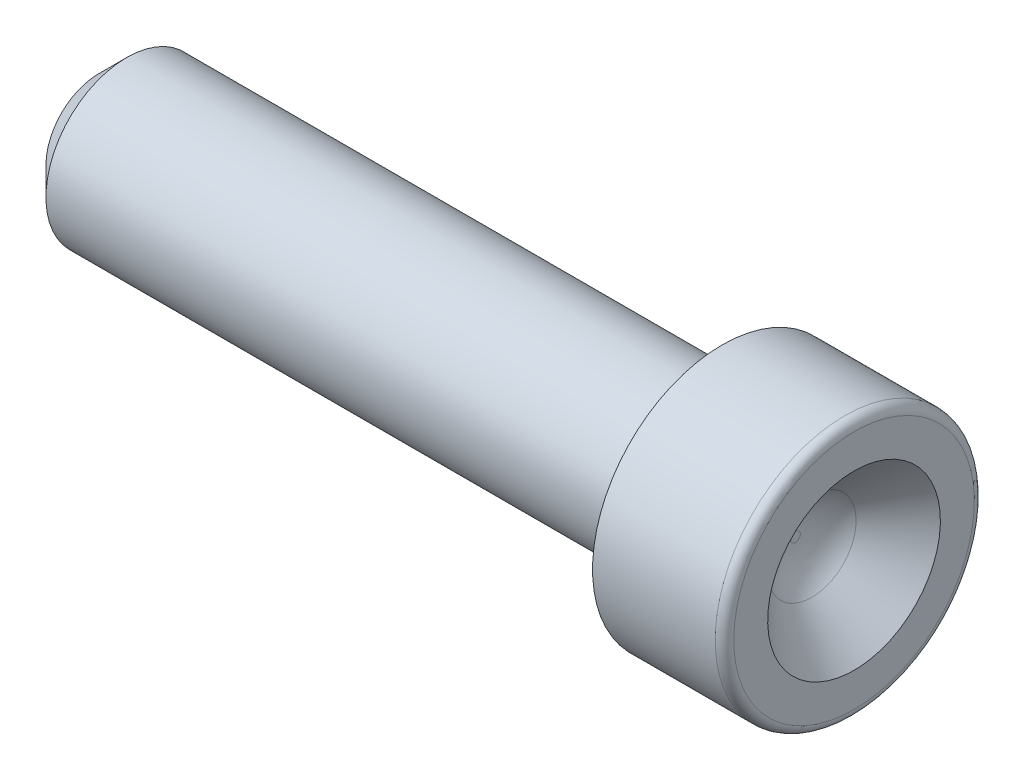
ISO-10303-21;
HEADER;
FILE_DESCRIPTION(('STEP AP214'),'2;1');
FILE_NAME('part.step','',(''),(''),'','','');
FILE_SCHEMA(('AUTOMOTIVE_DESIGN { 1 0 10303 214 1 1 1 1 }'));
ENDSEC;
DATA;
#1=APPLICATION_CONTEXT('core data for automotive mechanical design processes');
#2=APPLICATION_PROTOCOL_DEFINITION('international standard','automotive_design',2000,#1);
#3=PRODUCT_CONTEXT('',#1,'mechanical');
#4=PRODUCT('Part','Part','',(#3));
#5=PRODUCT_RELATED_PRODUCT_CATEGORY('part','',(#4));
#6=PRODUCT_DEFINITION_FORMATION('','',#4);
#7=PRODUCT_DEFINITION_CONTEXT('part definition',#1,'design');
#8=PRODUCT_DEFINITION('design','',#6,#7);
#9=PRODUCT_DEFINITION_SHAPE('','',#8);
#10=(LENGTH_UNIT() NAMED_UNIT(*) SI_UNIT(.MILLI.,.METRE.));
#11=(NAMED_UNIT(*) PLANE_ANGLE_UNIT() SI_UNIT($,.RADIAN.));
#12=(NAMED_UNIT(*) SI_UNIT($,.STERADIAN.) SOLID_ANGLE_UNIT());
#13=UNCERTAINTY_MEASURE_WITH_UNIT(LENGTH_MEASURE(1.E-05),#10,'distance_accuracy_value','');
#14=(GEOMETRIC_REPRESENTATION_CONTEXT(3) GLOBAL_UNCERTAINTY_ASSIGNED_CONTEXT((#13)) GLOBAL_UNIT_ASSIGNED_CONTEXT((#10,
#11,#12)) REPRESENTATION_CONTEXT('',''));
#15=CARTESIAN_POINT('',(0.,0.,0.));
#16=DIRECTION('',(0.,0.,1.));
#17=DIRECTION('',(1.,0.,0.));
#18=AXIS2_PLACEMENT_3D('',#15,#16,#17);
#19=CARTESIAN_POINT('',(0.,2.21,0.));
#20=DIRECTION('',(1.,0.,0.));
#21=DIRECTION('',(0.,1.,0.));
#22=AXIS2_PLACEMENT_3D('',#19,#20,#21);
#23=PLANE('',#22);
#24=CARTESIAN_POINT('',(0.,2.21,0.));
#25=DIRECTION('',(1.,0.,0.));
#26=DIRECTION('',(0.,1.,0.));
#27=AXIS2_PLACEMENT_3D('',#24,#25,#26);
#28=CIRCLE('',#27,1.44799999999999);
#29=CARTESIAN_POINT('',(0.,2.21,-1.44799999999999));
#30=VERTEX_POINT('',#29);
#31=EDGE_CURVE('E48',#30,#30,#28,.F.);
#32=ORIENTED_EDGE('',*,*,#31,.T.);
#33=EDGE_LOOP('',(#32));
#34=FACE_BOUND('',#33,.T.);
#35=ADVANCED_FACE('F28',(#34),#23,.F.);
#36=CARTESIAN_POINT('',(19.05,2.21,0.));
#37=DIRECTION('',(1.,0.,0.));
#38=DIRECTION('',(0.,1.,0.));
#39=AXIS2_PLACEMENT_3D('',#36,#37,#38);
#40=CYLINDRICAL_SURFACE('',#39,2.21);
#41=CARTESIAN_POINT('',(0.762000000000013,2.21,0.));
#42=DIRECTION('',(1.,0.,0.));
#43=DIRECTION('',(0.,0.,-1.));
#44=AXIS2_PLACEMENT_3D('',#41,#42,#43);
#45=CIRCLE('',#44,2.21);
#46=CARTESIAN_POINT('',(0.762000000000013,2.21,-2.21));
#47=VERTEX_POINT('',#46);
#48=EDGE_CURVE('E51',#47,#47,#45,.T.);
#49=ORIENTED_EDGE('',*,*,#48,.T.);
#50=EDGE_LOOP('',(#49));
#51=FACE_BOUND('',#50,.T.);
#52=CARTESIAN_POINT('',(16.535,2.21,0.));
#53=DIRECTION('',(1.,0.,0.));
#54=DIRECTION('',(0.,1.,0.));
#55=AXIS2_PLACEMENT_3D('',#52,#53,#54);
#56=CIRCLE('',#55,2.21);
#57=CARTESIAN_POINT('',(16.535,4.42,0.));
#58=VERTEX_POINT('',#57);
#59=EDGE_CURVE('E54',#58,#58,#56,.F.);
#60=ORIENTED_EDGE('',*,*,#59,.T.);
#61=EDGE_LOOP('',(#60));
#62=FACE_BOUND('',#61,.T.);
#63=ADVANCED_FACE('F83',(#51,#62),#40,.T.);
#64=CARTESIAN_POINT('',(17.043,-1.333,0.));
#65=DIRECTION('',(1.,0.,0.));
#66=DIRECTION('',(0.,1.,0.));
#67=AXIS2_PLACEMENT_3D('',#64,#65,#66);
#68=PLANE('',#67);
#69=CARTESIAN_POINT('',(17.043,2.21,0.));
#70=DIRECTION('',(1.,0.,0.));
#71=DIRECTION('',(0.,1.,0.));
#72=AXIS2_PLACEMENT_3D('',#69,#70,#71);
#73=CIRCLE('',#72,2.718);
#74=CARTESIAN_POINT('',(17.043,4.928,0.));
#75=VERTEX_POINT('',#74);
#76=EDGE_CURVE('E57',#75,#75,#73,.T.);
#77=ORIENTED_EDGE('',*,*,#76,.T.);
#78=EDGE_LOOP('',(#77));
#79=FACE_BOUND('',#78,.T.);
#80=CARTESIAN_POINT('',(17.043,2.21,0.));
#81=DIRECTION('',(1.,0.,0.));
#82=DIRECTION('',(0.,1.,0.));
#83=AXIS2_PLACEMENT_3D('',#80,#81,#82);
#84=CIRCLE('',#83,3.543);
#85=CARTESIAN_POINT('',(17.043,5.753,0.));
#86=VERTEX_POINT('',#85);
#87=EDGE_CURVE('E60',#86,#86,#84,.T.);
#88=ORIENTED_EDGE('',*,*,#87,.F.);
#89=EDGE_LOOP('',(#88));
#90=FACE_BOUND('',#89,.T.);
#91=ADVANCED_FACE('F80',(#79,#90),#68,.F.);
#92=CARTESIAN_POINT('',(19.05,2.21,0.));
#93=DIRECTION('',(1.,0.,0.));
#94=DIRECTION('',(0.,1.,0.));
#95=AXIS2_PLACEMENT_3D('',#92,#93,#94);
#96=CYLINDRICAL_SURFACE('',#95,3.543);
#97=CARTESIAN_POINT('',(20.396,2.21,0.));
#98=DIRECTION('',(-1.,0.,0.));
#99=DIRECTION('',(0.,-1.,0.));
#100=AXIS2_PLACEMENT_3D('',#97,#98,#99);
#101=CIRCLE('',#100,3.543);
#102=CARTESIAN_POINT('',(20.396,-1.333,0.));
#103=VERTEX_POINT('',#102);
#104=EDGE_CURVE('E10',#103,#103,#101,.T.);
#105=ORIENTED_EDGE('',*,*,#104,.T.);
#106=EDGE_LOOP('',(#105));
#107=FACE_BOUND('',#106,.T.);
#108=ORIENTED_EDGE('',*,*,#87,.T.);
#109=EDGE_LOOP('',(#108));
#110=FACE_BOUND('',#109,.T.);
#111=ADVANCED_FACE('F71',(#107,#110),#96,.T.);
#112=CARTESIAN_POINT('',(20.65,-0.15199999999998,0.));
#113=DIRECTION('',(-1.,0.,0.));
#114=DIRECTION('',(0.,-1.,0.));
#115=AXIS2_PLACEMENT_3D('',#112,#113,#114);
#116=PLANE('',#115);
#117=CARTESIAN_POINT('',(20.65,2.21,0.));
#118=DIRECTION('',(-1.,0.,0.));
#119=DIRECTION('',(0.,-1.,0.));
#120=AXIS2_PLACEMENT_3D('',#117,#118,#119);
#121=CIRCLE('',#120,3.289);
#122=CARTESIAN_POINT('',(20.65,-1.079,0.));
#123=VERTEX_POINT('',#122);
#124=EDGE_CURVE('E35',#123,#123,#121,.F.);
#125=ORIENTED_EDGE('',*,*,#124,.T.);
#126=EDGE_LOOP('',(#125));
#127=FACE_BOUND('',#126,.T.);
#128=CARTESIAN_POINT('',(20.65,2.21,0.));
#129=DIRECTION('',(1.,0.,0.));
#130=DIRECTION('',(0.,1.,0.));
#131=AXIS2_PLACEMENT_3D('',#128,#129,#130);
#132=CIRCLE('',#131,2.36199999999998);
#133=CARTESIAN_POINT('',(20.65,4.57199999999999,0.));
#134=VERTEX_POINT('',#133);
#135=EDGE_CURVE('E63',#134,#134,#132,.T.);
#136=ORIENTED_EDGE('',*,*,#135,.F.);
#137=EDGE_LOOP('',(#136));
#138=FACE_BOUND('',#137,.T.);
#139=ADVANCED_FACE('F69',(#127,#138),#116,.F.);
#140=CARTESIAN_POINT('',(20.65,2.21,0.));
#141=DIRECTION('',(1.,0.,0.));
#142=DIRECTION('',(0.,1.,0.));
#143=AXIS2_PLACEMENT_3D('',#140,#141,#142);
#144=CONICAL_SURFACE('',#143,2.36199999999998,0.785398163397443);
#145=CARTESIAN_POINT('',(19.4963692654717,2.21,0.));
#146=DIRECTION('',(1.,0.,0.));
#147=DIRECTION('',(0.,1.,0.));
#148=AXIS2_PLACEMENT_3D('',#145,#146,#147);
#149=CIRCLE('',#148,1.2083692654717);
#150=CARTESIAN_POINT('',(19.4963692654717,3.41836926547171,0.));
#151=VERTEX_POINT('',#150);
#152=EDGE_CURVE('E39',#151,#151,#149,.F.);
#153=ORIENTED_EDGE('',*,*,#152,.T.);
#154=EDGE_LOOP('',(#153));
#155=FACE_BOUND('',#154,.T.);
#156=ORIENTED_EDGE('',*,*,#135,.T.);
#157=EDGE_LOOP('',(#156));
#158=FACE_BOUND('',#157,.T.);
#159=ADVANCED_FACE('F67',(#155,#158),#144,.F.);
#160=CARTESIAN_POINT('',(19.05,1.448,0.));
#161=DIRECTION('',(-1.,0.,0.));
#162=DIRECTION('',(0.,-1.,0.));
#163=AXIS2_PLACEMENT_3D('',#160,#161,#162);
#164=PLANE('',#163);
#165=CARTESIAN_POINT('',(19.05,2.21,0.));
#166=DIRECTION('',(-1.,0.,0.));
#167=DIRECTION('',(0.,-1.,0.));
#168=AXIS2_PLACEMENT_3D('',#165,#166,#167);
#169=CIRCLE('',#168,0.1307385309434);
#170=CARTESIAN_POINT('',(19.05,2.0792614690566,0.));
#171=VERTEX_POINT('',#170);
#172=EDGE_CURVE('E43',#171,#171,#169,.F.);
#173=ORIENTED_EDGE('',*,*,#172,.T.);
#174=EDGE_LOOP('',(#173));
#175=FACE_BOUND('',#174,.T.);
#176=ADVANCED_FACE('F77',(#175),#164,.F.);
#177=CARTESIAN_POINT('',(16.535,2.21,0.));
#178=DIRECTION('',(1.,0.,0.));
#179=DIRECTION('',(0.,1.,0.));
#180=AXIS2_PLACEMENT_3D('',#177,#178,#179);
#181=TOROIDAL_SURFACE('',#180,2.718,0.508);
#182=ORIENTED_EDGE('',*,*,#59,.F.);
#183=EDGE_LOOP('',(#182));
#184=FACE_BOUND('',#183,.T.);
#185=ORIENTED_EDGE('',*,*,#76,.F.);
#186=EDGE_LOOP('',(#185));
#187=FACE_BOUND('',#186,.T.);
#188=ADVANCED_FACE('F93',(#184,#187),#181,.F.);
#189=CARTESIAN_POINT('',(0.762000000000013,2.21,0.));
#190=DIRECTION('',(1.,0.,0.));
#191=DIRECTION('',(0.,0.,-1.));
#192=AXIS2_PLACEMENT_3D('',#189,#190,#191);
#193=CONICAL_SURFACE('',#192,2.21,0.785398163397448);
#194=CARTESIAN_POINT('',(0.,2.21,-1.44799999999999));
#195=CARTESIAN_POINT('',(0.0079375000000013,2.21,-1.45593749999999));
#196=CARTESIAN_POINT('',(0.0158750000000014,2.21,-1.46387499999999));
#197=CARTESIAN_POINT('',(0.0317500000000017,2.21,-1.47974999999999));
#198=CARTESIAN_POINT('',(0.0396875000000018,2.21,-1.48768749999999));
#199=CARTESIAN_POINT('',(0.055562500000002,2.21,-1.50356249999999));
#200=CARTESIAN_POINT('',(0.0635000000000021,2.21,-1.51149999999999));
#201=CARTESIAN_POINT('',(0.0793750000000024,2.21,-1.52737499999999));
#202=CARTESIAN_POINT('',(0.0873125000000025,2.21,-1.53531249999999));
#203=CARTESIAN_POINT('',(0.103187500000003,2.21,-1.55118749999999));
#204=CARTESIAN_POINT('',(0.111125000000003,2.21,-1.55912499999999));
#205=CARTESIAN_POINT('',(0.127000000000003,2.21,-1.57499999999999));
#206=CARTESIAN_POINT('',(0.134937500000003,2.21,-1.58293749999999));
#207=CARTESIAN_POINT('',(0.150812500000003,2.21,-1.59881249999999));
#208=CARTESIAN_POINT('',(0.158750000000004,2.21,-1.60674999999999));
#209=CARTESIAN_POINT('',(0.174625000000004,2.21,-1.62262499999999));
#210=CARTESIAN_POINT('',(0.182562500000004,2.21,-1.63056249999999));
#211=CARTESIAN_POINT('',(0.198437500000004,2.21,-1.64643749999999));
#212=CARTESIAN_POINT('',(0.206375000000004,2.21,-1.65437499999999));
#213=CARTESIAN_POINT('',(0.222250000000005,2.21,-1.67024999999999));
#214=CARTESIAN_POINT('',(0.230187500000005,2.21,-1.67818749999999));
#215=CARTESIAN_POINT('',(0.246062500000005,2.21,-1.69406249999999));
#216=CARTESIAN_POINT('',(0.254000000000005,2.21,-1.70199999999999));
#217=CARTESIAN_POINT('',(0.269875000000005,2.21,-1.71787499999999));
#218=CARTESIAN_POINT('',(0.277812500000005,2.21,-1.72581249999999));
#219=CARTESIAN_POINT('',(0.293687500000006,2.21,-1.74168749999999));
#220=CARTESIAN_POINT('',(0.301625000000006,2.21,-1.74962499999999));
#221=CARTESIAN_POINT('',(0.317500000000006,2.21,-1.76549999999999));
#222=CARTESIAN_POINT('',(0.325437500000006,2.21,-1.77343749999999));
#223=CARTESIAN_POINT('',(0.341312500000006,2.21,-1.78931249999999));
#224=CARTESIAN_POINT('',(0.349250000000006,2.21,-1.79724999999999));
#225=CARTESIAN_POINT('',(0.365125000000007,2.21,-1.81312499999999));
#226=CARTESIAN_POINT('',(0.373062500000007,2.21,-1.82106249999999));
#227=CARTESIAN_POINT('',(0.388937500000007,2.21,-1.8369375));
#228=CARTESIAN_POINT('',(0.396875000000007,2.21,-1.844875));
#229=CARTESIAN_POINT('',(0.412750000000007,2.21,-1.86075));
#230=CARTESIAN_POINT('',(0.420687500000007,2.21,-1.8686875));
#231=CARTESIAN_POINT('',(0.436562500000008,2.21,-1.8845625));
#232=CARTESIAN_POINT('',(0.444500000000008,2.21,-1.8925));
#233=CARTESIAN_POINT('',(0.460375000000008,2.21,-1.908375));
#234=CARTESIAN_POINT('',(0.468312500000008,2.21,-1.9163125));
#235=CARTESIAN_POINT('',(0.484187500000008,2.21,-1.9321875));
#236=CARTESIAN_POINT('',(0.492125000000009,2.21,-1.940125));
#237=CARTESIAN_POINT('',(0.508000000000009,2.21,-1.956));
#238=CARTESIAN_POINT('',(0.515937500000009,2.21,-1.9639375));
#239=CARTESIAN_POINT('',(0.531812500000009,2.21,-1.9798125));
#240=CARTESIAN_POINT('',(0.539750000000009,2.21,-1.98775));
#241=CARTESIAN_POINT('',(0.555625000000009,2.21,-2.003625));
#242=CARTESIAN_POINT('',(0.56356250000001,2.21,-2.0115625));
#243=CARTESIAN_POINT('',(0.57943750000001,2.21,-2.0274375));
#244=CARTESIAN_POINT('',(0.58737500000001,2.21,-2.035375));
#245=CARTESIAN_POINT('',(0.60325000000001,2.21,-2.05125));
#246=CARTESIAN_POINT('',(0.61118750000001,2.21,-2.0591875));
#247=CARTESIAN_POINT('',(0.627062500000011,2.21,-2.0750625));
#248=CARTESIAN_POINT('',(0.635000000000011,2.21,-2.083));
#249=CARTESIAN_POINT('',(0.650875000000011,2.21,-2.098875));
#250=CARTESIAN_POINT('',(0.658812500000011,2.21,-2.1068125));
#251=CARTESIAN_POINT('',(0.674687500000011,2.21,-2.1226875));
#252=CARTESIAN_POINT('',(0.682625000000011,2.21,-2.130625));
#253=CARTESIAN_POINT('',(0.698500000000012,2.21,-2.1465));
#254=CARTESIAN_POINT('',(0.706437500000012,2.21,-2.1544375));
#255=CARTESIAN_POINT('',(0.722312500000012,2.21,-2.1703125));
#256=CARTESIAN_POINT('',(0.730250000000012,2.21,-2.17825));
#257=CARTESIAN_POINT('',(0.746125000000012,2.21,-2.194125));
#258=CARTESIAN_POINT('',(0.754062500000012,2.21,-2.2020625));
#259=CARTESIAN_POINT('',(0.762000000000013,2.21,-2.21));
#260=B_SPLINE_CURVE_WITH_KNOTS('',3,(#194,#195,#196,#197,#198,#199,#200,#201,#202,#203,#204,
#205,#206,#207,#208,#209,#210,#211,#212,#213,#214,#215,#216,#217,#218,#219,#220,#221,#222,#223,
#224,#225,#226,#227,#228,#229,#230,#231,#232,#233,#234,#235,#236,#237,#238,#239,#240,#241,#242,
#243,#244,#245,#246,#247,#248,#249,#250,#251,#252,#253,#254,#255,#256,#257,#258,#259),
.UNSPECIFIED.,.F.,.F.,(4,2,2,2,2,2,2,2,2,2,2,2,2,2,2,2,2,2,2,2,2,2,2,2,2,2,2,2,2,2,2,2,4),(0.,
0.0336759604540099,0.0673519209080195,0.101027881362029,0.134703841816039,0.168379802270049,
0.202055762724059,0.235731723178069,0.269407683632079,0.303083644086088,0.336759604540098,
0.370435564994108,0.404111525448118,0.437787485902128,0.471463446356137,0.505139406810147,
0.538815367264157,0.572491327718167,0.606167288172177,0.639843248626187,0.673519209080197,
0.707195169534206,0.740871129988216,0.774547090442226,0.808223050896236,0.841899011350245,
0.875574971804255,0.909250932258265,0.942926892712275,0.976602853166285,1.01027881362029,
1.0439547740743,1.07763073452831),.UNSPECIFIED.);
#261=EDGE_CURVE('BSEAM96',#30,#47,#260,.T.);
#262=ORIENTED_EDGE('',*,*,#31,.F.);
#263=ORIENTED_EDGE('',*,*,#48,.F.);
#264=ORIENTED_EDGE('',*,*,#261,.T.);
#265=ORIENTED_EDGE('',*,*,#261,.F.);
#266=EDGE_LOOP('',(#262,#264,#263,#265));
#267=FACE_BOUND('',#266,.T.);
#268=ADVANCED_FACE('F96',(#267),#193,.T.);
#269=CARTESIAN_POINT('',(20.574,2.21,0.));
#270=DIRECTION('',(-1.,0.,0.));
#271=DIRECTION('',(0.,-1.,0.));
#272=AXIS2_PLACEMENT_3D('',#269,#270,#271);
#273=DEGENERATE_TOROIDAL_SURFACE('',#272,0.1307385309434,1.524,.T.);
#274=ORIENTED_EDGE('',*,*,#152,.F.);
#275=EDGE_LOOP('',(#274));
#276=FACE_BOUND('',#275,.T.);
#277=ORIENTED_EDGE('',*,*,#172,.F.);
#278=EDGE_LOOP('',(#277));
#279=FACE_BOUND('',#278,.T.);
#280=ADVANCED_FACE('F99',(#276,#279),#273,.F.);
#281=CARTESIAN_POINT('',(20.396,2.21,0.));
#282=DIRECTION('',(-1.,0.,0.));
#283=DIRECTION('',(0.,-1.,0.));
#284=AXIS2_PLACEMENT_3D('',#281,#282,#283);
#285=TOROIDAL_SURFACE('',#284,3.289,0.254);
#286=ORIENTED_EDGE('',*,*,#104,.F.);
#287=EDGE_LOOP('',(#286));
#288=FACE_BOUND('',#287,.T.);
#289=ORIENTED_EDGE('',*,*,#124,.F.);
#290=EDGE_LOOP('',(#289));
#291=FACE_BOUND('',#290,.T.);
#292=ADVANCED_FACE('F30',(#288,#291),#285,.T.);
#293=CLOSED_SHELL('',(#35,#63,#91,#111,#139,#159,#176,#188,#268,#280,#292));
#294=MANIFOLD_SOLID_BREP('B2',#293);
#295=ADVANCED_BREP_SHAPE_REPRESENTATION('',(#18,#294),#14);
#296=SHAPE_DEFINITION_REPRESENTATION(#9,#295);
ENDSEC;
END-ISO-10303-21;
